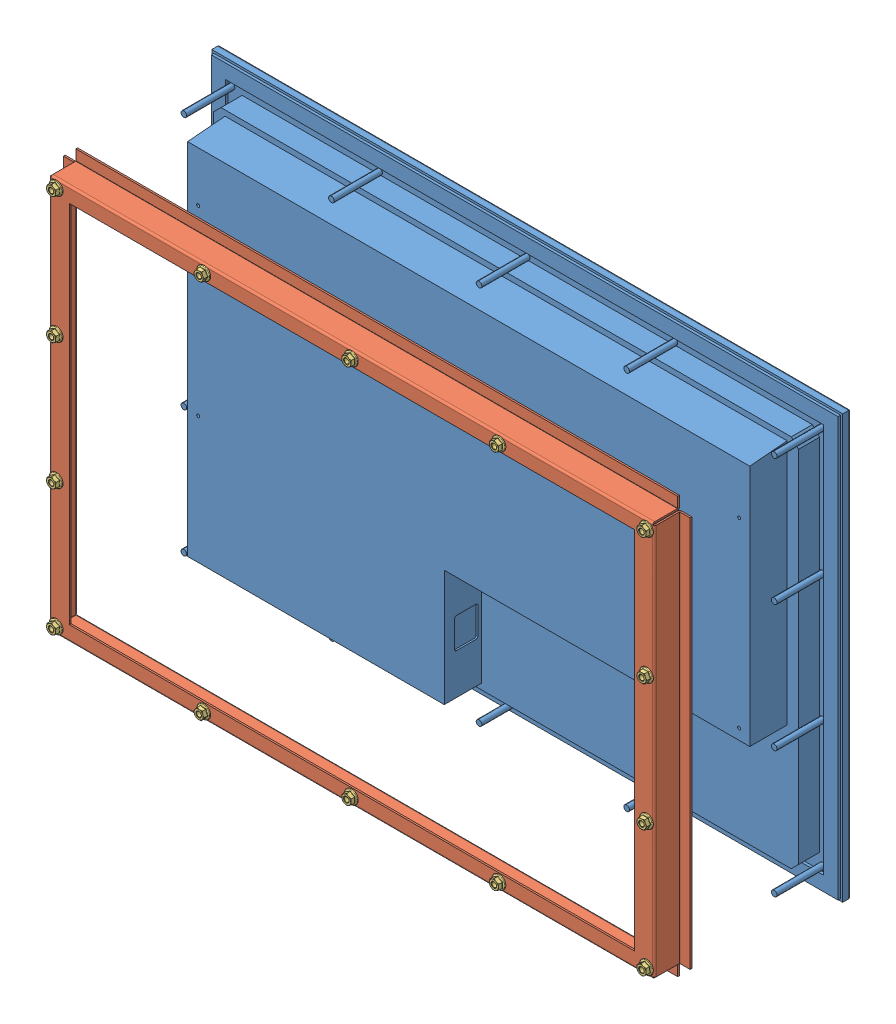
SolidWorks assembly 22 inch Panel Mount Monitor, HIS-ML22-xxxB.SLDASM, configuration Default (file format 10000). Lengths in mm.
Overall size (558.8 374.65 167.39).
16 component instances, 3 part files, 30 mates.
Components (placement in the parent):
- Monitor, 22B-2: Monitor, 22B.sldprt [Default] at origin size (558.8 374.65 58.98)
- Collar, 10767-1: Collar, 10767.SLDPRT [Default] at (0 0 153.7611) size (554.99 368.45 23.57)
- M5 Nut, 30008-1: M5 Nut, 30008.sldprt [M5 Nut - 30008] at (-261.4168 168.1226 160.28) size (11.8 11.8 5)
- M5 Nut, 30008-2: M5 Nut, 30008.sldprt [M5 Nut - 30008] at (-130.7084 168.1226 160.28) x (0 -1 0) z (0 0 1) size (11.8 11.8 5)
- M5 Nut, 30008-3: M5 Nut, 30008.sldprt [M5 Nut - 30008] at (0 168.1226 160.28) size (11.8 11.8 5)
- M5 Nut, 30008-4: M5 Nut, 30008.sldprt [M5 Nut - 30008] at (130.7084 168.1226 160.28) size (11.8 11.8 5)
- M5 Nut, 30008-5: M5 Nut, 30008.sldprt [M5 Nut - 30008] at (261.4168 168.1226 160.28) size (11.8 11.8 5)
- M5 Nut, 30008-6: M5 Nut, 30008.sldprt [M5 Nut - 30008] at (261.4168 56.0324 160.28) x (0 -1 0) z (0 0 1) size (11.8 11.8 5)
- M5 Nut, 30008-7: M5 Nut, 30008.sldprt [M5 Nut - 30008] at (261.4168 -56.0578 160.28) x (0 -1 0) z (0 0 1) size (11.8 11.8 5)
- M5 Nut, 30008-8: M5 Nut, 30008.sldprt [M5 Nut - 30008] at (261.4168 -168.1226 160.28) x (0.381849 0.924225 0) z (0 0 1) size (11.8 11.8 5)
- M5 Nut, 30008-9: M5 Nut, 30008.sldprt [M5 Nut - 30008] at (130.7084 -168.1226 160.28) size (11.8 11.8 5)
- M5 Nut, 30008-10: M5 Nut, 30008.sldprt [M5 Nut - 30008] at (0 -168.1226 160.28) size (11.8 11.8 5)
- M5 Nut, 30008-11: M5 Nut, 30008.sldprt [M5 Nut - 30008] at (-130.7084 -168.1226 160.28) x (0.923728 0.383049 0) z (0 0 1) size (11.8 11.8 5)
- M5 Nut, 30008-12: M5 Nut, 30008.sldprt [M5 Nut - 30008] at (-261.4168 -168.1226 160.28) size (11.8 11.8 5)
- M5 Nut, 30008-13: M5 Nut, 30008.sldprt [M5 Nut - 30008] at (-261.4168 -56.0578 160.28) size (11.8 11.8 5)
- M5 Nut, 30008-14: M5 Nut, 30008.sldprt [M5 Nut - 30008] at (-261.4168 56.0324 160.28) size (11.8 11.8 5)
Mates (geometry in assembly coordinates):
- Concentric1: concentric anti-aligned: cylinder of Monitor, 22B-2 through (261.4168 168.1226 42.7) axis (0 0 -1) radius 2.5; cylinder of Collar, 10767-1 through (261.4168 168.1226 155.28) axis (0 0 1) radius 3.175
- Parallel1: parallel anti-aligned: line of Monitor, 22B-2 through (558.8 279.4 187.325) axis (0 -1 0); line of Collar, 10767-1 through (-266.4442 184.2262 133.2278) axis (1 0 0)
- Concentric21: concentric: cylinder of Collar, 10767-1 through (-261.4168 168.1226 155.28) axis (0 0 1) radius 3.175; cylinder of M5 Nut, 30008-1 through (-257.6962 172.0838 139.6868) axis (0 0 1) radius 2.5
- Coincident11: coincident: plane of Collar, 10767-1 through (0 0 155.28) normal (0 0 1); plane of M5 Nut, 30008-1 through (-257.6962 176.7026 159.7243) normal (0 0 -1)
- Concentric31: concentric: cylinder of Collar, 10767-1 through (-130.7084 168.1226 155.28) axis (0 0 1) radius 3.175; cylinder of M5 Nut, 30008-2 through (-169.036 127.3164 95.7868) axis (0 0 1) radius 2.5
- Coincident21: coincident: plane of Collar, 10767-1 through (0 0 155.28) normal (0 0 1); plane of M5 Nut, 30008-2 through (-164.4172 127.3164 115.8243) normal (0 0 -1)
- Concentric41: concentric: cylinder of Collar, 10767-1 through (0 168.1226 155.28) axis (0 0 1) radius 3.175; cylinder of M5 Nut, 30008-3 through (-84.6202 85.7582 52.9225) axis (0 0 1) radius 2.5
- Coincident31: coincident: plane of Collar, 10767-1 through (0 0 155.28) normal (0 0 1); plane of M5 Nut, 30008-3 through (-84.6202 90.377 72.96) normal (0 0 -1)
- Concentric51: concentric: cylinder of Collar, 10767-1 through (130.7084 168.1226 155.28) axis (0 0 1) radius 3.175; cylinder of M5 Nut, 30008-4 through (5.2369 40.2783 8.5379) axis (0 0 1) radius 2.5
- Coincident41: coincident: plane of Collar, 10767-1 through (0 0 155.28) normal (0 0 1); plane of M5 Nut, 30008-4 through (5.2369 44.8971 28.5754) normal (0 0 -1)
- Concentric61: concentric: cylinder of Collar, 10767-1 through (261.4168 168.1226 155.28) axis (0 0 1) radius 3.175; cylinder of M5 Nut, 30008-5 through (92.2327 -2.9211 -35.2656) axis (0 0 1) radius 2.5
- Coincident51: coincident: plane of Collar, 10767-1 through (0 0 155.28) normal (0 0 1); plane of M5 Nut, 30008-5 through (92.2327 1.6977 -15.2281) normal (0 0 -1)
- Concentric71: concentric: cylinder of Collar, 10767-1 through (261.4168 56.0324 155.28) axis (0 0 1) radius 3.175; cylinder of M5 Nut, 30008-6 through (129.7694 -77.1991 46.5387) axis (0 0 -1) radius 2.5
- Coincident61: coincident: plane of Collar, 10767-1 through (0 0 155.28) normal (0 0 1); plane of M5 Nut, 30008-6 through (134.0359 -75.4299 26.5012) normal (0 0 1)
- Concentric81: concentric: cylinder of Collar, 10767-1 through (261.4168 -56.0578 155.28) axis (0 0 1) radius 3.175; cylinder of M5 Nut, 30008-7 through (168.277 -153.1394 38.884) axis (0 0 1) radius 2.5
- Coincident71: coincident: plane of Collar, 10767-1 through (0 0 155.28) normal (0 0 1); plane of M5 Nut, 30008-7 through (172.8958 -153.1394 58.9215) normal (0 0 -1)
- Concentric91: concentric: cylinder of Collar, 10767-1 through (261.4168 -168.1226 155.28) axis (0 0 1) radius 3.175; cylinder of M5 Nut, 30008-8 through (204.031 -226.4263 76.405) axis (0 0 1) radius 2.5
- Coincident81: coincident: plane of Collar, 10767-1 through (0 0 155.28) normal (0 0 1); plane of M5 Nut, 30008-8 through (199.7622 -224.6626 96.4425) normal (0 0 -1)
- Concentric101: concentric: cylinder of Collar, 10767-1 through (130.7084 -168.1226 155.28) axis (0 0 1) radius 3.175; cylinder of M5 Nut, 30008-9 through (118.3772 -183.6614 119.3008) axis (0 0 1) radius 2.5
- Coincident91: coincident: plane of Collar, 10767-1 through (0 0 155.28) normal (0 0 1); plane of M5 Nut, 30008-9 through (118.3772 -179.0426 139.3383) normal (0 0 -1)
- Concentric111: concentric: cylinder of Collar, 10767-1 through (0 -168.1226 155.28) axis (0 0 1) radius 3.175; cylinder of M5 Nut, 30008-10 through (28.0218 -138.2558 164.258) axis (0 0 1) radius 2.5
- Coincident101: coincident: plane of Collar, 10767-1 through (0 0 155.28) normal (0 0 1); plane of M5 Nut, 30008-10 through (28.0218 -133.637 184.2955) normal (0 0 -1)
- Concentric121: concentric: cylinder of Collar, 10767-1 through (-130.7084 -168.1226 155.28) axis (0 0 1) radius 3.175; cylinder of M5 Nut, 30008-11 through (-55.1782 -97.4997 206.7085) axis (0 0 1) radius 2.5
- Coincident111: coincident: plane of Collar, 10767-1 through (0 0 155.28) normal (0 0 1); plane of M5 Nut, 30008-11 through (-56.9474 -93.2332 226.746) normal (0 0 -1)
- Concentric131: concentric: cylinder of Collar, 10767-1 through (-261.4168 -168.1226 155.28) axis (0 0 1) radius 3.175; cylinder of M5 Nut, 30008-12 through (-142.2683 -53.5166 249.8227) axis (0 0 1) radius 2.5
- Coincident121: coincident: plane of Collar, 10767-1 through (0 0 155.28) normal (0 0 1); plane of M5 Nut, 30008-12 through (-142.2683 -48.8978 269.8602) normal (0 0 -1)
- Concentric141: concentric: cylinder of Collar, 10767-1 through (-261.4168 -56.0578 155.28) axis (0 0 1) radius 3.175; cylinder of M5 Nut, 30008-13 through (-183.7737 26.4242 211.4003) axis (0 0 1) radius 2.5
- Coincident131: coincident: plane of Collar, 10767-1 through (0 0 155.28) normal (0 0 1); plane of M5 Nut, 30008-13 through (-183.7737 31.043 231.4378) normal (0 0 -1)
- Concentric151: concentric: cylinder of Collar, 10767-1 through (-261.4168 56.0324 155.28) axis (0 0 1) radius 3.175; cylinder of M5 Nut, 30008-14 through (-217.5994 96.2587 175.4028) axis (0 0 1) radius 2.5
- Coincident141: coincident: plane of Collar, 10767-1 through (0 0 155.28) normal (0 0 1); plane of M5 Nut, 30008-14 through (-217.5994 100.8775 195.4403) normal (0 0 -1)
